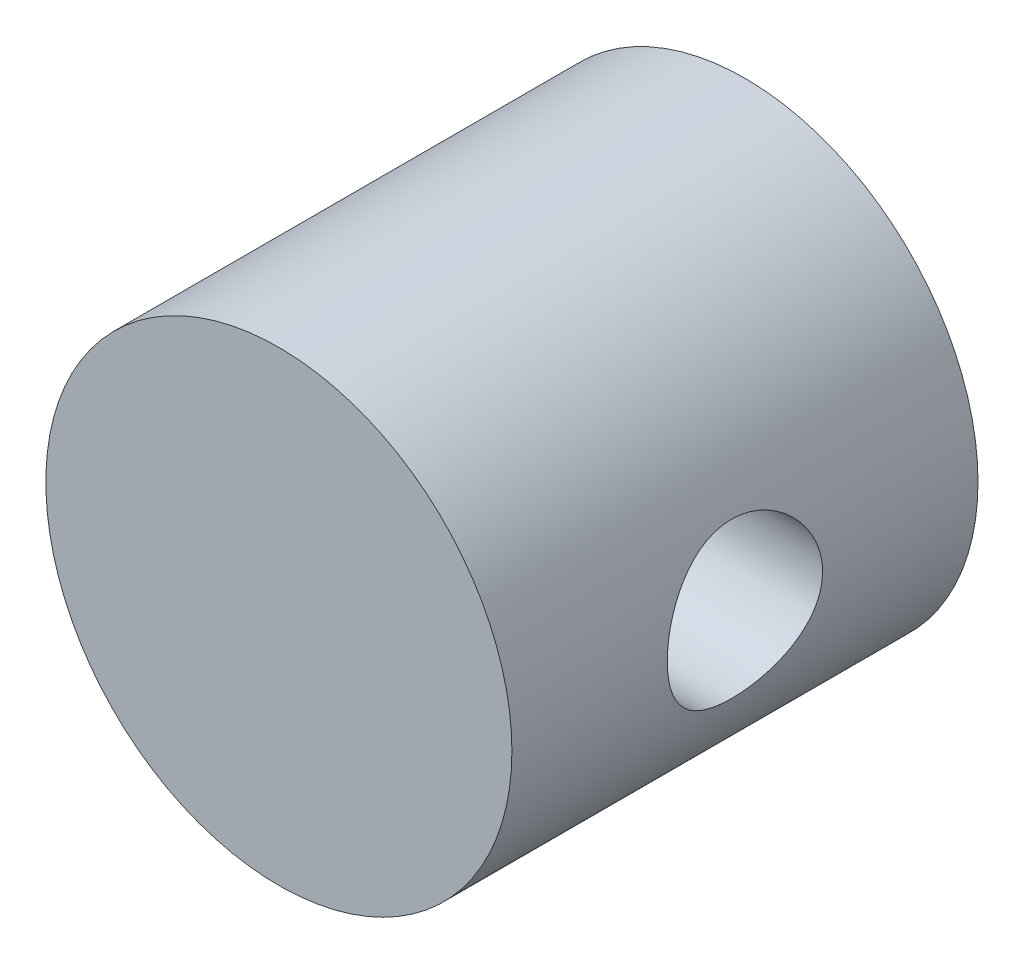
ISO-10303-21;
HEADER;
FILE_DESCRIPTION(('STEP AP214'),'2;1');
FILE_NAME('part.step','',(''),(''),'','','');
FILE_SCHEMA(('AUTOMOTIVE_DESIGN { 1 0 10303 214 1 1 1 1 }'));
ENDSEC;
DATA;
#1=APPLICATION_CONTEXT('core data for automotive mechanical design processes');
#2=APPLICATION_PROTOCOL_DEFINITION('international standard','automotive_design',2000,#1);
#3=PRODUCT_CONTEXT('',#1,'mechanical');
#4=PRODUCT('Part','Part','',(#3));
#5=PRODUCT_RELATED_PRODUCT_CATEGORY('part','',(#4));
#6=PRODUCT_DEFINITION_FORMATION('','',#4);
#7=PRODUCT_DEFINITION_CONTEXT('part definition',#1,'design');
#8=PRODUCT_DEFINITION('design','',#6,#7);
#9=PRODUCT_DEFINITION_SHAPE('','',#8);
#10=(LENGTH_UNIT() NAMED_UNIT(*) SI_UNIT(.MILLI.,.METRE.));
#11=(NAMED_UNIT(*) PLANE_ANGLE_UNIT() SI_UNIT($,.RADIAN.));
#12=(NAMED_UNIT(*) SI_UNIT($,.STERADIAN.) SOLID_ANGLE_UNIT());
#13=UNCERTAINTY_MEASURE_WITH_UNIT(LENGTH_MEASURE(1.E-05),#10,'distance_accuracy_value','');
#14=(GEOMETRIC_REPRESENTATION_CONTEXT(3) GLOBAL_UNCERTAINTY_ASSIGNED_CONTEXT((#13)) GLOBAL_UNIT_ASSIGNED_CONTEXT((#10,
#11,#12)) REPRESENTATION_CONTEXT('',''));
#15=CARTESIAN_POINT('',(0.,0.,0.));
#16=DIRECTION('',(0.,0.,1.));
#17=DIRECTION('',(1.,0.,0.));
#18=AXIS2_PLACEMENT_3D('',#15,#16,#17);
#19=CARTESIAN_POINT('',(0.,0.,15.0000000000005));
#20=DIRECTION('',(0.,0.,-1.00000000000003));
#21=DIRECTION('',(-1.,0.,0.));
#22=AXIS2_PLACEMENT_3D('',#19,#20,#21);
#23=CYLINDRICAL_SURFACE('',#22,7.5);
#24=CARTESIAN_POINT('',(7.50000000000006,1.11022302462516E-13,5.00000000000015));
#25=CARTESIAN_POINT('',(7.50000038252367,-0.136408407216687,4.99999936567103));
#26=CARTESIAN_POINT('',(7.49624423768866,-0.272812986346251,5.01120066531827));
#27=CARTESIAN_POINT('',(7.48163025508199,-0.541604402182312,5.05557277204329));
#28=CARTESIAN_POINT('',(7.47077168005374,-0.673990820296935,5.08874585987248));
#29=CARTESIAN_POINT('',(7.44313269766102,-0.930831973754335,5.17579810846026));
#30=CARTESIAN_POINT('',(7.42636219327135,-1.05529956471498,5.22964265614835));
#31=CARTESIAN_POINT('',(7.38861114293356,-1.29343734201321,5.35635293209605));
#32=CARTESIAN_POINT('',(7.36762976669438,-1.40710539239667,5.42922241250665));
#33=CARTESIAN_POINT('',(7.32285236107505,-1.6243541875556,5.59456451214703));
#34=CARTESIAN_POINT('',(7.29898891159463,-1.72750925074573,5.68757808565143));
#35=CARTESIAN_POINT('',(7.25150786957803,-1.91708173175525,5.88941788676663));
#36=CARTESIAN_POINT('',(7.22789033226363,-2.00349546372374,5.99824758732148));
#37=CARTESIAN_POINT('',(7.18283331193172,-2.15956235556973,6.23246278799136));
#38=CARTESIAN_POINT('',(7.16147598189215,-2.22866214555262,6.35823434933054));
#39=CARTESIAN_POINT('',(7.12438263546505,-2.34454718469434,6.6204402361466));
#40=CARTESIAN_POINT('',(7.10864490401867,-2.391339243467,6.75687129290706));
#41=CARTESIAN_POINT('',(7.08528258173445,-2.459683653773,7.03168305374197));
#42=CARTESIAN_POINT('',(7.07740239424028,-2.48203362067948,7.16984302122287));
#43=CARTESIAN_POINT('',(7.06989141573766,-2.50335280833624,7.44815938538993));
#44=CARTESIAN_POINT('',(7.07025807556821,-2.50232925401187,7.58831515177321));
#45=CARTESIAN_POINT('',(7.07897537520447,-2.47754975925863,7.85984157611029));
#46=CARTESIAN_POINT('',(7.08696039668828,-2.45483478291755,7.99132100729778));
#47=CARTESIAN_POINT('',(7.10941644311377,-2.3890154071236,8.24848354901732));
#48=CARTESIAN_POINT('',(7.12388824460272,-2.34590856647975,8.37416596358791));
#49=CARTESIAN_POINT('',(7.15794777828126,-2.23984764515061,8.61853187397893));
#50=CARTESIAN_POINT('',(7.17761414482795,-2.17658512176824,8.73707006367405));
#51=CARTESIAN_POINT('',(7.2198139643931,-2.03222276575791,8.96217727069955));
#52=CARTESIAN_POINT('',(7.24234824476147,-1.95111778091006,9.06874281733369));
#53=CARTESIAN_POINT('',(7.28918322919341,-1.76837333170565,9.27272899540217));
#54=CARTESIAN_POINT('',(7.31351473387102,-1.66588287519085,9.36938173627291));
#55=CARTESIAN_POINT('',(7.36017345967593,-1.44584892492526,9.54432816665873));
#56=CARTESIAN_POINT('',(7.38250048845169,-1.32830398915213,9.62262009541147));
#57=CARTESIAN_POINT('',(7.42292769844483,-1.07986903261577,9.75924075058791));
#58=CARTESIAN_POINT('',(7.44098375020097,-0.948858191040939,9.81736372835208));
#59=CARTESIAN_POINT('',(7.47051417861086,-0.67817270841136,9.91050793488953));
#60=CARTESIAN_POINT('',(7.48199084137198,-0.53850109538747,9.94553718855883));
#61=CARTESIAN_POINT('',(7.49669067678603,-0.260959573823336,9.99013916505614));
#62=CARTESIAN_POINT('',(7.50025004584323,-0.123273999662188,10.0007495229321));
#63=CARTESIAN_POINT('',(7.49972256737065,0.151937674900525,9.99916831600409));
#64=CARTESIAN_POINT('',(7.49563701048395,0.289463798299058,9.98698060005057));
#65=CARTESIAN_POINT('',(7.4805006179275,0.556299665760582,9.94097023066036));
#66=CARTESIAN_POINT('',(7.46965496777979,0.685732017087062,9.90778448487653));
#67=CARTESIAN_POINT('',(7.44229617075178,0.937139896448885,9.82151638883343));
#68=CARTESIAN_POINT('',(7.42578230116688,1.05911447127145,9.76843150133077));
#69=CARTESIAN_POINT('',(7.38822328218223,1.29572074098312,9.64232392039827));
#70=CARTESIAN_POINT('',(7.36707036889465,1.41007489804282,9.56881351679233));
#71=CARTESIAN_POINT('',(7.32263134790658,1.62516207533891,9.40451462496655));
#72=CARTESIAN_POINT('',(7.29934458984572,1.72589091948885,9.31372085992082));
#73=CARTESIAN_POINT('',(7.25192119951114,1.91563126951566,9.11255312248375));
#74=CARTESIAN_POINT('',(7.22779402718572,2.00390242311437,9.0014769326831));
#75=CARTESIAN_POINT('',(7.18249933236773,2.16064380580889,8.76557108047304));
#76=CARTESIAN_POINT('',(7.16133183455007,2.22911386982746,8.64074130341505));
#77=CARTESIAN_POINT('',(7.12455979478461,2.34399232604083,8.38081746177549));
#78=CARTESIAN_POINT('',(7.1089440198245,2.3904453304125,8.24574480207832));
#79=CARTESIAN_POINT('',(7.08527080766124,2.45973666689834,7.96905337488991));
#80=CARTESIAN_POINT('',(7.07720996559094,2.48258563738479,7.82743758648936));
#81=CARTESIAN_POINT('',(7.0699464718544,2.5031907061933,7.54950725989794));
#82=CARTESIAN_POINT('',(7.07031000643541,2.50217564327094,7.41329414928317));
#83=CARTESIAN_POINT('',(7.07878174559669,2.47810573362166,7.14308731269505));
#84=CARTESIAN_POINT('',(7.08688948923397,2.45505219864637,7.00909345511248));
#85=CARTESIAN_POINT('',(7.10961310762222,2.38842953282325,6.74966084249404));
#86=CARTESIAN_POINT('',(7.12410245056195,2.34525836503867,6.62410793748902));
#87=CARTESIAN_POINT('',(7.15790997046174,2.23994841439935,6.38193148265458));
#88=CARTESIAN_POINT('',(7.17722921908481,2.1778054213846,6.26530992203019));
#89=CARTESIAN_POINT('',(7.21957073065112,2.03315173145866,6.03879082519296));
#90=CARTESIAN_POINT('',(7.24271779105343,1.94987060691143,5.92940874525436));
#91=CARTESIAN_POINT('',(7.28958390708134,1.76660720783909,5.72577546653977));
#92=CARTESIAN_POINT('',(7.3133031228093,1.66662021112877,5.63152856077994));
#93=CARTESIAN_POINT('',(7.35975076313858,1.44810389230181,5.4571389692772));
#94=CARTESIAN_POINT('',(7.38240454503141,1.32900378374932,5.37768913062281));
#95=CARTESIAN_POINT('',(7.4231497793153,1.07839339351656,5.24002392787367));
#96=CARTESIAN_POINT('',(7.44124239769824,0.946886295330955,5.181803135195));
#97=CARTESIAN_POINT('',(7.47013787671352,0.681234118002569,5.09069591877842));
#98=CARTESIAN_POINT('',(7.48123031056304,0.547469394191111,5.05679383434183));
#99=CARTESIAN_POINT('',(7.49616017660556,0.27580104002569,5.01144929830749));
#100=CARTESIAN_POINT('',(7.49999961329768,0.137898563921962,5.00000064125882));
#101=CARTESIAN_POINT('',(7.50000000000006,1.11022302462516E-13,5.00000000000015));
#102=B_SPLINE_CURVE_WITH_KNOTS('',3,(#24,#25,#26,#27,#28,#29,#30,#31,#32,#33,#34,#35,#36,#37,
#38,#39,#40,#41,#42,#43,#44,#45,#46,#47,#48,#49,#50,#51,#52,#53,#54,#55,#56,#57,#58,#59,#60,#61,
#62,#63,#64,#65,#66,#67,#68,#69,#70,#71,#72,#73,#74,#75,#76,#77,#78,#79,#80,#81,#82,#83,#84,#85,
#86,#87,#88,#89,#90,#91,#92,#93,#94,#95,#96,#97,#98,#99,#100,#101),.UNSPECIFIED.,.T.,.F.,(4,2,2,
2,2,2,2,2,2,2,2,2,2,2,2,2,2,2,2,2,2,2,2,2,2,2,2,2,2,2,2,2,2,2,2,2,2,2,4),(0.,0.408717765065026,
0.817477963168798,1.22555668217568,1.63371594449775,2.054617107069,2.47561083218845,
2.90870962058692,3.34167611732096,3.76004814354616,4.17829084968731,4.57742066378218,
4.97659827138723,5.38220427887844,5.78792756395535,6.21483264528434,6.64177864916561,
7.0729601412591,7.50399172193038,7.91633957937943,8.32861782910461,8.72895394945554,
9.1293411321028,9.54025999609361,9.95130452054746,10.381025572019,10.8107502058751,
11.2396003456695,11.6682571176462,12.0748916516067,12.4815019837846,12.8803896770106,
13.2793659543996,13.6957516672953,14.1122552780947,14.5449915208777,14.9776170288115,
15.3909139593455,15.8040966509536),.UNSPECIFIED.);
#103=CARTESIAN_POINT('',(7.50000000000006,0.,10.0000000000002));
#104=VERTEX_POINT('',#103);
#105=CARTESIAN_POINT('',(7.50000000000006,1.11022302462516E-13,5.00000000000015));
#106=VERTEX_POINT('',#105);
#107=EDGE_CURVE('E89',#104,#106,#102,.T.);
#108=ORIENTED_EDGE('',*,*,#107,.T.);
#109=EDGE_CURVE('E60',#106,#104,#102,.T.);
#110=ORIENTED_EDGE('',*,*,#109,.T.);
#111=EDGE_LOOP('',(#108,#110));
#112=FACE_BOUND('',#111,.T.);
#113=CARTESIAN_POINT('',(-7.49999999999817,0.,5.00000000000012));
#114=CARTESIAN_POINT('',(-7.50000038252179,0.136408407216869,4.99999936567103));
#115=CARTESIAN_POINT('',(-7.49624423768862,0.27281298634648,5.01120066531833));
#116=CARTESIAN_POINT('',(-7.48163025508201,0.541604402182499,5.05557277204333));
#117=CARTESIAN_POINT('',(-7.47077168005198,0.67399082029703,5.08874585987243));
#118=CARTESIAN_POINT('',(-7.44313269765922,0.930831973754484,5.1757981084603));
#119=CARTESIAN_POINT('',(-7.4263621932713,1.05529956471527,5.22964265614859));
#120=CARTESIAN_POINT('',(-7.38861114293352,1.29343734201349,5.35635293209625));
#121=CARTESIAN_POINT('',(-7.36762976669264,1.40710539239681,5.42922241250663));
#122=CARTESIAN_POINT('',(-7.32285236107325,1.62435418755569,5.59456451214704));
#123=CARTESIAN_POINT('',(-7.29898891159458,1.72750925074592,5.6875780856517));
#124=CARTESIAN_POINT('',(-7.251507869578,1.91708173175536,5.88941788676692));
#125=CARTESIAN_POINT('',(-7.22789033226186,2.00349546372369,5.99824758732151));
#126=CARTESIAN_POINT('',(-7.18283331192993,2.15956235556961,6.23246278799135));
#127=CARTESIAN_POINT('',(-7.16147598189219,2.2286621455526,6.35823434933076));
#128=CARTESIAN_POINT('',(-7.12438263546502,2.34454718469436,6.62044023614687));
#129=CARTESIAN_POINT('',(-7.10864490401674,2.39133924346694,6.75687129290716));
#130=CARTESIAN_POINT('',(-7.08528258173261,2.45968365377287,7.03168305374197));
#131=CARTESIAN_POINT('',(-7.07740239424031,2.48203362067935,7.16984302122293));
#132=CARTESIAN_POINT('',(-7.0698914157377,2.50335280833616,7.44815938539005));
#133=CARTESIAN_POINT('',(-7.07025807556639,2.50232925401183,7.58831515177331));
#134=CARTESIAN_POINT('',(-7.07897537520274,2.4775497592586,7.85984157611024));
#135=CARTESIAN_POINT('',(-7.08696039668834,2.45483478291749,7.99132100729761));
#136=CARTESIAN_POINT('',(-7.10941644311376,2.38901540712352,8.2484835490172));
#137=CARTESIAN_POINT('',(-7.12388824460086,2.34590856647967,8.37416596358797));
#138=CARTESIAN_POINT('',(-7.15794777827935,2.23984764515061,8.61853187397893));
#139=CARTESIAN_POINT('',(-7.17761414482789,2.17658512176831,8.73707006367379));
#140=CARTESIAN_POINT('',(-7.21981396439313,2.03222276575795,8.96217727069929));
#141=CARTESIAN_POINT('',(-7.24234824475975,1.95111778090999,9.06874281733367));
#142=CARTESIAN_POINT('',(-7.28918322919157,1.76837333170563,9.2727289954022));
#143=CARTESIAN_POINT('',(-7.31351473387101,1.66588287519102,9.36938173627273));
#144=CARTESIAN_POINT('',(-7.36017345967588,1.44584892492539,9.54432816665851));
#145=CARTESIAN_POINT('',(-7.3825004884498,1.32830398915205,9.62262009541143));
#146=CARTESIAN_POINT('',(-7.42292769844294,1.07986903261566,9.75924075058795));
#147=CARTESIAN_POINT('',(-7.44098375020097,0.94885819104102,9.81736372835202));
#148=CARTESIAN_POINT('',(-7.47051417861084,0.678172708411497,9.91050793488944));
#149=CARTESIAN_POINT('',(-7.48199084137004,0.538501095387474,9.94553718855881));
#150=CARTESIAN_POINT('',(-7.49669067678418,0.26095957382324,9.99013916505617));
#151=CARTESIAN_POINT('',(-7.50025004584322,0.123273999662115,10.0007495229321));
#152=CARTESIAN_POINT('',(-7.49972256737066,-0.151937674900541,9.99916831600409));
#153=CARTESIAN_POINT('',(-7.49563701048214,-0.289463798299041,9.98698060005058));
#154=CARTESIAN_POINT('',(-7.48050061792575,-0.556299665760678,9.94097023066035));
#155=CARTESIAN_POINT('',(-7.46965496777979,-0.685732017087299,9.90778448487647));
#156=CARTESIAN_POINT('',(-7.44229617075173,-0.937139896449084,9.82151638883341));
#157=CARTESIAN_POINT('',(-7.42578230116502,-1.05911447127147,9.76843150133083));
#158=CARTESIAN_POINT('',(-7.38822328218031,-1.29572074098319,9.64232392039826));
#159=CARTESIAN_POINT('',(-7.36707036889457,-1.41007489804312,9.56881351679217));
#160=CARTESIAN_POINT('',(-7.32263134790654,-1.62516207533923,9.40451462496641));
#161=CARTESIAN_POINT('',(-7.29934458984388,-1.72589091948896,9.31372085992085));
#162=CARTESIAN_POINT('',(-7.2519211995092,-1.91563126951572,9.11255312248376));
#163=CARTESIAN_POINT('',(-7.22779402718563,-2.00390242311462,9.00147693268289));
#164=CARTESIAN_POINT('',(-7.18249933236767,-2.16064380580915,8.76557108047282));
#165=CARTESIAN_POINT('',(-7.16133183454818,-2.22911386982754,8.64074130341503));
#166=CARTESIAN_POINT('',(-7.12455979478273,-2.34399232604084,8.38081746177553));
#167=CARTESIAN_POINT('',(-7.10894401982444,-2.39044533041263,8.24574480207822));
#168=CARTESIAN_POINT('',(-7.0852708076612,-2.45973666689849,7.96905337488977));
#169=CARTESIAN_POINT('',(-7.07720996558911,-2.48258563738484,7.82743758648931));
#170=CARTESIAN_POINT('',(-7.06994647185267,-2.50319070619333,7.54950725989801));
#171=CARTESIAN_POINT('',(-7.07031000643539,-2.50217564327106,7.41329414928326));
#172=CARTESIAN_POINT('',(-7.07878174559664,-2.47810573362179,7.14308731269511));
#173=CARTESIAN_POINT('',(-7.08688948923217,-2.45505219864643,7.00909345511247));
#174=CARTESIAN_POINT('',(-7.10961310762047,-2.38842953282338,6.7496608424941));
#175=CARTESIAN_POINT('',(-7.12410245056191,-2.34525836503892,6.6241079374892));
#176=CARTESIAN_POINT('',(-7.15790997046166,-2.23994841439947,6.38193148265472));
#177=CARTESIAN_POINT('',(-7.17722921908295,-2.17780542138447,6.26530992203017));
#178=CARTESIAN_POINT('',(-7.21957073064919,-2.03315173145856,6.03879082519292));
#179=CARTESIAN_POINT('',(-7.24271779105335,-1.94987060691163,5.92940874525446));
#180=CARTESIAN_POINT('',(-7.2895839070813,-1.76660720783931,5.7257754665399));
#181=CARTESIAN_POINT('',(-7.31330312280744,-1.66662021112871,5.63152856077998));
#182=CARTESIAN_POINT('',(-7.35975076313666,-1.44810389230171,5.45713896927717));
#183=CARTESIAN_POINT('',(-7.38240454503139,-1.32900378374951,5.37768913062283));
#184=CARTESIAN_POINT('',(-7.42314977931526,-1.07839339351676,5.24002392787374));
#185=CARTESIAN_POINT('',(-7.44124239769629,-0.94688629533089,5.18180313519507));
#186=CARTESIAN_POINT('',(-7.47013787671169,-0.681234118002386,5.09069591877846));
#187=CARTESIAN_POINT('',(-7.48123031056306,-0.547469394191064,5.05679383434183));
#188=CARTESIAN_POINT('',(-7.49616017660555,-0.275801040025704,5.01144929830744));
#189=CARTESIAN_POINT('',(-7.49999961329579,-0.137898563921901,5.00000064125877));
#190=CARTESIAN_POINT('',(-7.49999999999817,0.,5.00000000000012));
#191=B_SPLINE_CURVE_WITH_KNOTS('',3,(#113,#114,#115,#116,#117,#118,#119,#120,#121,#122,#123,
#124,#125,#126,#127,#128,#129,#130,#131,#132,#133,#134,#135,#136,#137,#138,#139,#140,#141,#142,
#143,#144,#145,#146,#147,#148,#149,#150,#151,#152,#153,#154,#155,#156,#157,#158,#159,#160,#161,
#162,#163,#164,#165,#166,#167,#168,#169,#170,#171,#172,#173,#174,#175,#176,#177,#178,#179,#180,
#181,#182,#183,#184,#185,#186,#187,#188,#189,#190),.UNSPECIFIED.,.T.,.F.,(4,2,2,2,2,2,2,2,2,2,2,
2,2,2,2,2,2,2,2,2,2,2,2,2,2,2,2,2,2,2,2,2,2,2,2,2,2,2,4),(0.,0.408717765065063,
0.817477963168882,1.22555668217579,1.63371594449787,2.05461710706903,2.4756108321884,
2.90870962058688,3.34167611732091,3.76004814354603,4.17829084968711,4.57742066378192,
4.97659827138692,5.3822042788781,5.78792756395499,6.21483264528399,6.64177864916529,
7.0729601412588,7.5039917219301,7.91633957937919,8.32861782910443,8.72895394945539,
9.12934113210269,9.54025999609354,9.95130452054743,10.3810255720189,10.810750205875,
11.2396003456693,11.668257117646,12.0748916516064,12.4815019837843,12.8803896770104,
13.2793659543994,13.695751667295,14.1122552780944,14.5449915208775,14.9776170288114,
15.3909139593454,15.8040966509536),.UNSPECIFIED.);
#192=CARTESIAN_POINT('',(-7.49999999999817,0.,10.0000000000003));
#193=VERTEX_POINT('',#192);
#194=CARTESIAN_POINT('',(-7.49999999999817,0.,5.00000000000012));
#195=VERTEX_POINT('',#194);
#196=EDGE_CURVE('E46',#193,#195,#191,.T.);
#197=ORIENTED_EDGE('',*,*,#196,.T.);
#198=EDGE_CURVE('E11',#195,#193,#191,.T.);
#199=ORIENTED_EDGE('',*,*,#198,.T.);
#200=EDGE_LOOP('',(#197,#199));
#201=FACE_BOUND('',#200,.T.);
#202=CARTESIAN_POINT('',(0.,0.,15.0000000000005));
#203=DIRECTION('',(0.,0.,1.00000000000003));
#204=DIRECTION('',(1.,0.,0.));
#205=AXIS2_PLACEMENT_3D('',#202,#203,#204);
#206=CIRCLE('',#205,7.5);
#207=CARTESIAN_POINT('',(7.5,0.,15.0000000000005));
#208=VERTEX_POINT('',#207);
#209=EDGE_CURVE('E80',#208,#208,#206,.T.);
#210=ORIENTED_EDGE('',*,*,#209,.F.);
#211=EDGE_LOOP('',(#210));
#212=FACE_BOUND('',#211,.T.);
#213=CARTESIAN_POINT('',(0.,0.,0.));
#214=DIRECTION('',(0.,0.,1.00000000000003));
#215=DIRECTION('',(1.,0.,0.));
#216=AXIS2_PLACEMENT_3D('',#213,#214,#215);
#217=CIRCLE('',#216,7.5);
#218=CARTESIAN_POINT('',(7.5,0.,0.));
#219=VERTEX_POINT('',#218);
#220=EDGE_CURVE('E83',#219,#219,#217,.T.);
#221=ORIENTED_EDGE('',*,*,#220,.T.);
#222=EDGE_LOOP('',(#221));
#223=FACE_BOUND('',#222,.T.);
#224=ADVANCED_FACE('F42',(#112,#201,#212,#223),#23,.T.);
#225=CARTESIAN_POINT('',(0.,0.,15.0000000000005));
#226=DIRECTION('',(0.,0.,1.00000000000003));
#227=DIRECTION('',(1.,0.,0.));
#228=AXIS2_PLACEMENT_3D('',#225,#226,#227);
#229=PLANE('',#228);
#230=ORIENTED_EDGE('',*,*,#209,.T.);
#231=EDGE_LOOP('',(#230));
#232=FACE_BOUND('',#231,.T.);
#233=ADVANCED_FACE('F75',(#232),#229,.T.);
#234=CARTESIAN_POINT('',(0.,0.,0.));
#235=DIRECTION('',(0.,0.,1.00000000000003));
#236=DIRECTION('',(1.,0.,0.));
#237=AXIS2_PLACEMENT_3D('',#234,#235,#236);
#238=PLANE('',#237);
#239=ORIENTED_EDGE('',*,*,#220,.F.);
#240=EDGE_LOOP('',(#239));
#241=FACE_BOUND('',#240,.T.);
#242=ADVANCED_FACE('F97',(#241),#238,.F.);
#243=CARTESIAN_POINT('',(7.50000000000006,0.,7.50000000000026));
#244=DIRECTION('',(1.,0.,0.));
#245=DIRECTION('',(0.,0.,-1.00000000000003));
#246=AXIS2_PLACEMENT_3D('',#243,#244,#245);
#247=CYLINDRICAL_SURFACE('',#246,2.5);
#248=ORIENTED_EDGE('',*,*,#107,.F.);
#249=ORIENTED_EDGE('',*,*,#109,.F.);
#250=EDGE_LOOP('',(#248,#249));
#251=FACE_BOUND('',#250,.T.);
#252=ORIENTED_EDGE('',*,*,#196,.F.);
#253=ORIENTED_EDGE('',*,*,#198,.F.);
#254=EDGE_LOOP('',(#252,#253));
#255=FACE_BOUND('',#254,.T.);
#256=ADVANCED_FACE('F70',(#251,#255),#247,.F.);
#257=CLOSED_SHELL('',(#224,#233,#242,#256));
#258=MANIFOLD_SOLID_BREP('B2',#257);
#259=ADVANCED_BREP_SHAPE_REPRESENTATION('',(#18,#258),#14);
#260=SHAPE_DEFINITION_REPRESENTATION(#9,#259);
ENDSEC;
END-ISO-10303-21;
